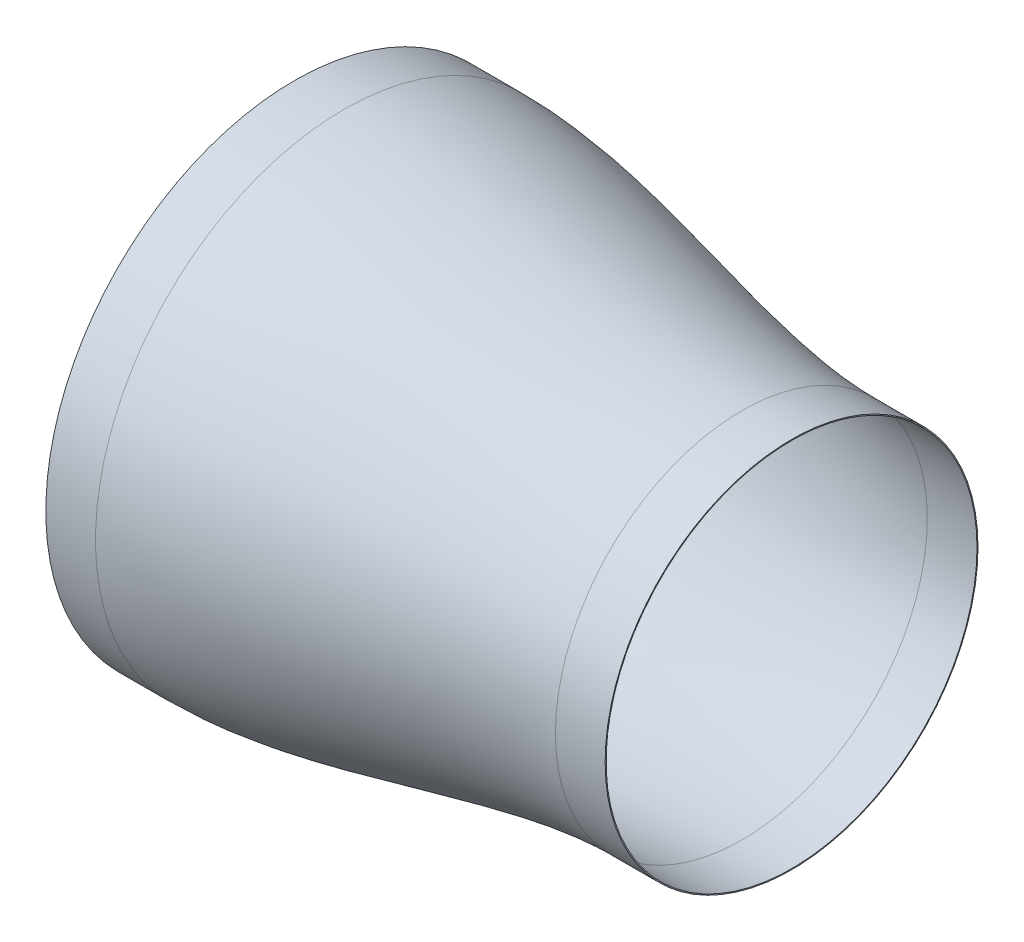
ISO-10303-21;
HEADER;
FILE_DESCRIPTION(('STEP AP214'),'2;1');
FILE_NAME('part.step','',(''),(''),'','','');
FILE_SCHEMA(('AUTOMOTIVE_DESIGN { 1 0 10303 214 1 1 1 1 }'));
ENDSEC;
DATA;
#1=APPLICATION_CONTEXT('core data for automotive mechanical design processes');
#2=APPLICATION_PROTOCOL_DEFINITION('international standard','automotive_design',2000,#1);
#3=PRODUCT_CONTEXT('',#1,'mechanical');
#4=PRODUCT('Part','Part','',(#3));
#5=PRODUCT_RELATED_PRODUCT_CATEGORY('part','',(#4));
#6=PRODUCT_DEFINITION_FORMATION('','',#4);
#7=PRODUCT_DEFINITION_CONTEXT('part definition',#1,'design');
#8=PRODUCT_DEFINITION('design','',#6,#7);
#9=PRODUCT_DEFINITION_SHAPE('','',#8);
#10=(LENGTH_UNIT() NAMED_UNIT(*) SI_UNIT(.MILLI.,.METRE.));
#11=(NAMED_UNIT(*) PLANE_ANGLE_UNIT() SI_UNIT($,.RADIAN.));
#12=(NAMED_UNIT(*) SI_UNIT($,.STERADIAN.) SOLID_ANGLE_UNIT());
#13=UNCERTAINTY_MEASURE_WITH_UNIT(LENGTH_MEASURE(1.E-05),#10,'distance_accuracy_value','');
#14=(GEOMETRIC_REPRESENTATION_CONTEXT(3) GLOBAL_UNCERTAINTY_ASSIGNED_CONTEXT((#13)) GLOBAL_UNIT_ASSIGNED_CONTEXT((#10,
#11,#12)) REPRESENTATION_CONTEXT('',''));
#15=CARTESIAN_POINT('',(0.,0.,0.));
#16=DIRECTION('',(0.,0.,1.));
#17=DIRECTION('',(1.,0.,0.));
#18=AXIS2_PLACEMENT_3D('',#15,#16,#17);
#19=CARTESIAN_POINT('',(0.,0.,0.));
#20=DIRECTION('',(1.,0.,0.));
#21=DIRECTION('',(0.,0.,-1.));
#22=AXIS2_PLACEMENT_3D('',#19,#20,#21);
#23=PLANE('',#22);
#24=CARTESIAN_POINT('',(0.,0.,0.));
#25=DIRECTION('',(1.,0.,0.));
#26=DIRECTION('',(0.,0.,-1.));
#27=AXIS2_PLACEMENT_3D('',#24,#25,#26);
#28=CIRCLE('',#27,500.);
#29=CARTESIAN_POINT('',(0.,0.,-500.));
#30=VERTEX_POINT('',#29);
#31=EDGE_CURVE('E48',#30,#30,#28,.T.);
#32=ORIENTED_EDGE('',*,*,#31,.F.);
#33=EDGE_LOOP('',(#32));
#34=FACE_BOUND('',#33,.T.);
#35=CARTESIAN_POINT('',(0.,0.,0.));
#36=DIRECTION('',(1.,0.,0.));
#37=DIRECTION('',(0.,0.,-1.));
#38=AXIS2_PLACEMENT_3D('',#35,#36,#37);
#39=CIRCLE('',#38,498.);
#40=CARTESIAN_POINT('',(0.,0.,-498.));
#41=VERTEX_POINT('',#40);
#42=EDGE_CURVE('E55',#41,#41,#39,.T.);
#43=ORIENTED_EDGE('',*,*,#42,.T.);
#44=EDGE_LOOP('',(#43));
#45=FACE_BOUND('',#44,.T.);
#46=ADVANCED_FACE('F44',(#34,#45),#23,.F.);
#47=CARTESIAN_POINT('',(100.,0.,0.));
#48=DIRECTION('',(-1.,0.,0.));
#49=DIRECTION('',(0.,0.,1.));
#50=AXIS2_PLACEMENT_3D('',#47,#48,#49);
#51=CYLINDRICAL_SURFACE('',#50,500.);
#52=CARTESIAN_POINT('',(100.,0.,0.));
#53=DIRECTION('',(1.,0.,0.));
#54=DIRECTION('',(0.,0.,-1.));
#55=AXIS2_PLACEMENT_3D('',#52,#53,#54);
#56=CIRCLE('',#55,500.);
#57=CARTESIAN_POINT('',(100.,0.,-500.));
#58=VERTEX_POINT('',#57);
#59=EDGE_CURVE('E11',#58,#58,#56,.T.);
#60=ORIENTED_EDGE('',*,*,#59,.F.);
#61=EDGE_LOOP('',(#60));
#62=FACE_BOUND('',#61,.T.);
#63=ORIENTED_EDGE('',*,*,#31,.T.);
#64=EDGE_LOOP('',(#63));
#65=FACE_BOUND('',#64,.T.);
#66=ADVANCED_FACE('F46',(#62,#65),#51,.T.);
#67=CARTESIAN_POINT('',(100.,0.,0.));
#68=DIRECTION('',(-1.,0.,0.));
#69=DIRECTION('',(0.,0.,1.));
#70=AXIS2_PLACEMENT_3D('',#67,#68,#69);
#71=CYLINDRICAL_SURFACE('',#70,498.);
#72=CARTESIAN_POINT('',(100.,0.,0.));
#73=DIRECTION('',(-1.,0.,0.));
#74=DIRECTION('',(0.,0.,1.));
#75=AXIS2_PLACEMENT_3D('',#72,#73,#74);
#76=CIRCLE('',#75,498.);
#77=CARTESIAN_POINT('',(100.,0.,498.));
#78=VERTEX_POINT('',#77);
#79=EDGE_CURVE('E62',#78,#78,#76,.T.);
#80=ORIENTED_EDGE('',*,*,#79,.F.);
#81=EDGE_LOOP('',(#80));
#82=FACE_BOUND('',#81,.T.);
#83=ORIENTED_EDGE('',*,*,#42,.F.);
#84=EDGE_LOOP('',(#83));
#85=FACE_BOUND('',#84,.T.);
#86=ADVANCED_FACE('F88',(#82,#85),#71,.F.);
#87=CARTESIAN_POINT('',(100.,498.,0.));
#88=CARTESIAN_POINT('',(165.057625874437,498.,0.));
#89=CARTESIAN_POINT('',(231.039921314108,490.204922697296,0.));
#90=CARTESIAN_POINT('',(364.38251604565,466.792842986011,0.));
#91=CARTESIAN_POINT('',(431.741259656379,451.176475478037,0.));
#92=CARTESIAN_POINT('',(567.360556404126,419.925670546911,0.));
#93=CARTESIAN_POINT('',(635.617980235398,404.292090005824,0.));
#94=CARTESIAN_POINT('',(770.079736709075,380.829946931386,0.));
#95=CARTESIAN_POINT('',(836.285045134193,373.,0.));
#96=CARTESIAN_POINT('',(900.000000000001,373.,0.));
#97=B_SPLINE_CURVE_WITH_KNOTS('',3,(#87,#88,#89,#90,#91,#92,#93,#94,#95,#96),.UNSPECIFIED.,.F.,
.F.,(4,2,2,2,4),(0.,0.25,0.5,0.75,1.),.UNSPECIFIED.);
#98=CARTESIAN_POINT('',(100.,0.,0.));
#99=DIRECTION('',(-1.,0.,0.));
#100=AXIS1_PLACEMENT('',#98,#99);
#101=SURFACE_OF_REVOLUTION('',#97,#100);
#102=CARTESIAN_POINT('',(900.000000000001,0.,0.));
#103=DIRECTION('',(-1.,0.,0.));
#104=DIRECTION('',(0.,0.,1.));
#105=AXIS2_PLACEMENT_3D('',#102,#103,#104);
#106=CIRCLE('',#105,373.);
#107=CARTESIAN_POINT('',(900.000000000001,0.,373.));
#108=VERTEX_POINT('',#107);
#109=EDGE_CURVE('E59',#108,#108,#106,.T.);
#110=ORIENTED_EDGE('',*,*,#109,.F.);
#111=EDGE_LOOP('',(#110));
#112=FACE_BOUND('',#111,.T.);
#113=ORIENTED_EDGE('',*,*,#79,.T.);
#114=EDGE_LOOP('',(#113));
#115=FACE_BOUND('',#114,.T.);
#116=ADVANCED_FACE('F83',(#112,#115),#101,.T.);
#117=CARTESIAN_POINT('',(100.,500.,0.));
#118=CARTESIAN_POINT('',(230.43469640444,500.,0.));
#119=CARTESIAN_POINT('',(498.333696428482,437.5,0.));
#120=CARTESIAN_POINT('',(772.897910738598,375.,0.));
#121=CARTESIAN_POINT('',(900.000000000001,375.,0.));
#122=B_SPLINE_CURVE_WITH_KNOTS('',3,(#117,#118,#119,#120,#121),.UNSPECIFIED.,.F.,.F.,(4,1,4),
(0.,0.5,1.),.UNSPECIFIED.);
#123=CARTESIAN_POINT('',(100.,0.,0.));
#124=DIRECTION('',(-1.,0.,0.));
#125=AXIS1_PLACEMENT('',#123,#124);
#126=SURFACE_OF_REVOLUTION('',#122,#125);
#127=CARTESIAN_POINT('',(900.,0.,0.));
#128=DIRECTION('',(1.,0.,0.));
#129=DIRECTION('',(0.,0.,-1.));
#130=AXIS2_PLACEMENT_3D('',#127,#128,#129);
#131=CIRCLE('',#130,375.);
#132=CARTESIAN_POINT('',(900.,0.,-375.));
#133=VERTEX_POINT('',#132);
#134=EDGE_CURVE('E65',#133,#133,#131,.T.);
#135=ORIENTED_EDGE('',*,*,#134,.F.);
#136=EDGE_LOOP('',(#135));
#137=FACE_BOUND('',#136,.T.);
#138=ORIENTED_EDGE('',*,*,#59,.T.);
#139=EDGE_LOOP('',(#138));
#140=FACE_BOUND('',#139,.T.);
#141=ADVANCED_FACE('F78',(#137,#140),#126,.F.);
#142=CARTESIAN_POINT('',(900.,0.,0.));
#143=DIRECTION('',(1.,0.,0.));
#144=DIRECTION('',(0.,0.,-1.));
#145=AXIS2_PLACEMENT_3D('',#142,#143,#144);
#146=CYLINDRICAL_SURFACE('',#145,375.);
#147=ORIENTED_EDGE('',*,*,#134,.T.);
#148=EDGE_LOOP('',(#147));
#149=FACE_BOUND('',#148,.T.);
#150=CARTESIAN_POINT('',(1000.,0.,0.));
#151=DIRECTION('',(1.,0.,0.));
#152=DIRECTION('',(0.,0.,-1.));
#153=AXIS2_PLACEMENT_3D('',#150,#151,#152);
#154=CIRCLE('',#153,375.);
#155=CARTESIAN_POINT('',(1000.,0.,-375.));
#156=VERTEX_POINT('',#155);
#157=EDGE_CURVE('E163',#156,#156,#154,.T.);
#158=ORIENTED_EDGE('',*,*,#157,.F.);
#159=EDGE_LOOP('',(#158));
#160=FACE_BOUND('',#159,.T.);
#161=ADVANCED_FACE('F82',(#149,#160),#146,.T.);
#162=CARTESIAN_POINT('',(1000.,0.,0.));
#163=DIRECTION('',(1.,0.,0.));
#164=DIRECTION('',(0.,0.,-1.));
#165=AXIS2_PLACEMENT_3D('',#162,#163,#164);
#166=PLANE('',#165);
#167=CARTESIAN_POINT('',(1000.,0.,0.));
#168=DIRECTION('',(1.,0.,0.));
#169=DIRECTION('',(0.,0.,-1.));
#170=AXIS2_PLACEMENT_3D('',#167,#168,#169);
#171=CIRCLE('',#170,373.);
#172=CARTESIAN_POINT('',(1000.,0.,-373.));
#173=VERTEX_POINT('',#172);
#174=EDGE_CURVE('E162',#173,#173,#171,.T.);
#175=ORIENTED_EDGE('',*,*,#174,.F.);
#176=EDGE_LOOP('',(#175));
#177=FACE_BOUND('',#176,.T.);
#178=ORIENTED_EDGE('',*,*,#157,.T.);
#179=EDGE_LOOP('',(#178));
#180=FACE_BOUND('',#179,.T.);
#181=ADVANCED_FACE('F123',(#177,#180),#166,.T.);
#182=CARTESIAN_POINT('',(900.,0.,0.));
#183=DIRECTION('',(1.,0.,0.));
#184=DIRECTION('',(0.,0.,-1.));
#185=AXIS2_PLACEMENT_3D('',#182,#183,#184);
#186=CYLINDRICAL_SURFACE('',#185,373.);
#187=ORIENTED_EDGE('',*,*,#109,.T.);
#188=EDGE_LOOP('',(#187));
#189=FACE_BOUND('',#188,.T.);
#190=ORIENTED_EDGE('',*,*,#174,.T.);
#191=EDGE_LOOP('',(#190));
#192=FACE_BOUND('',#191,.T.);
#193=ADVANCED_FACE('F130',(#189,#192),#186,.F.);
#194=CLOSED_SHELL('',(#46,#66,#86,#116,#141,#161,#181,#193));
#195=MANIFOLD_SOLID_BREP('B2',#194);
#196=ADVANCED_BREP_SHAPE_REPRESENTATION('',(#18,#195),#14);
#197=SHAPE_DEFINITION_REPRESENTATION(#9,#196);
ENDSEC;
END-ISO-10303-21;
